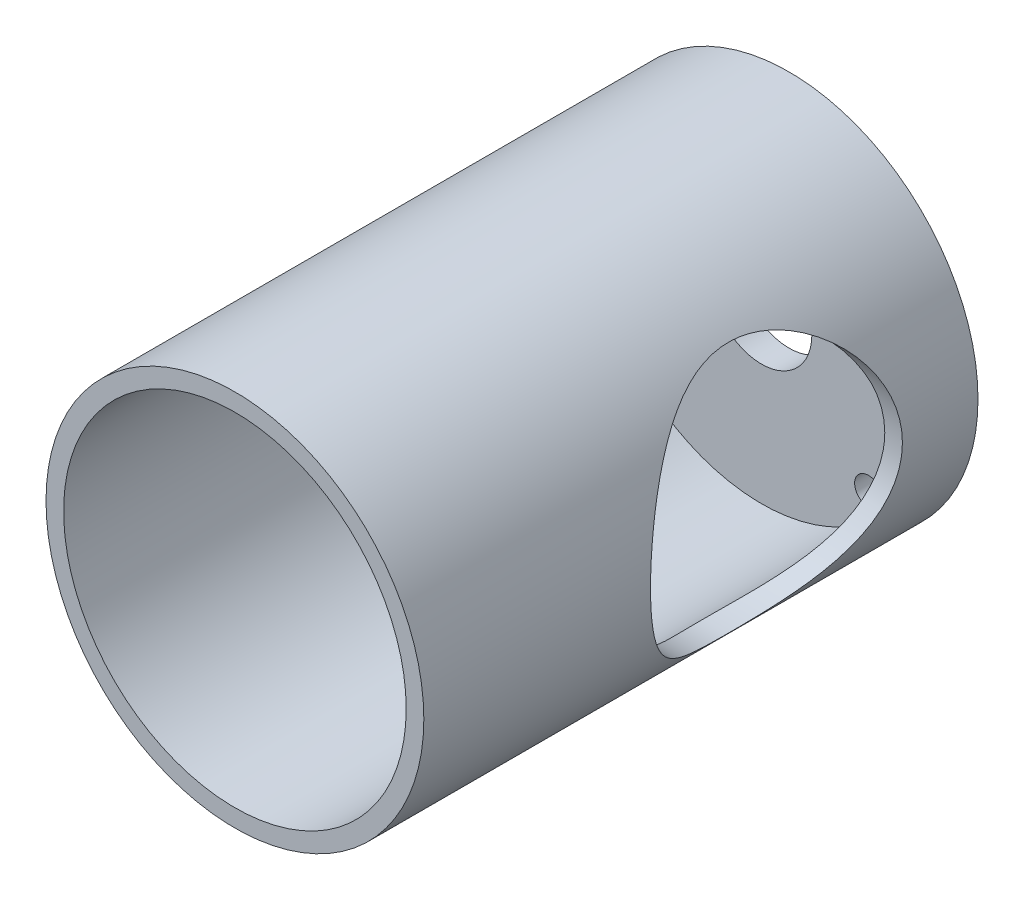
from build123d import *

# Parameters (mm, degrees)
SKETCH1_W               = 0.3048
SKETCH1_H               = 2.7
SKETCH2_R               = 1.7272
CUT_EXTRUDE1_DEPTH      = 12.7
CIRPATTERN1_COUNT       = 4
CUT_EXTRUDE2_DEPTH      = 78.544134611
CUT_EXTRUDE2_DEPTH_BACK = 78.544134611
SKETCH3_R               = 15.875


with BuildPart() as part:
    # Sketch1 → Revolve1 (revolve)
    with BuildSketch(Plane(origin=(0, 0, 0), x_dir=(0, 0, -1), z_dir=(1, 0, 0)), mode=Mode.PRIVATE) as revolve1_sk:
        Polygon((-3.4798, 21.59), (-3.4798, 6.35), (-0.3048, 6.35), (-0.3048, 9.05), (0, 9.05), (0, 23.8125), (-69.85, 23.8125), (-69.85, 21.59), align=None)
        with Locations((-0.1524, 7.7)):
            Rectangle(SKETCH1_W, SKETCH1_H)
    revolve(revolve1_sk.sketch.rotate(Axis((0, 0, 8.824688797), (0, 0, -1)), 90), axis=Axis((0, 0, 8.824688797), (0, 0, -1)))

    # Sketch2 → Cut-Extrude1 (cut)
    with BuildSketch(Plane(origin=(0, 0, 0), x_dir=(-1, 0, 0), z_dir=(0, 0, -1))):
        with Locations((13.470384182, 13.470384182)):
            Circle(SKETCH2_R)
    cut_extrude1 = extrude(amount=-CUT_EXTRUDE1_DEPTH, mode=Mode.SUBTRACT)

    # CirPattern1: Cut-Extrude1 ×4 about axis
    cirpattern1_axis = Axis((0, 0, 0), (0, 0, 1))
    for i in range(1, CIRPATTERN1_COUNT):
        add(cut_extrude1.rotate(cirpattern1_axis, i * 360 / CIRPATTERN1_COUNT), mode=Mode.SUBTRACT)

    # Sketch3 → Cut-Extrude2 (cut, two sides: drawn at the far end of the back side and taken through both)
    with BuildSketch(Plane(origin=(0, 0, 0), x_dir=(0, 0, -1), z_dir=(1, 0, 0)).offset(-CUT_EXTRUDE2_DEPTH_BACK)):
        with Locations((-25.4, 0)):
            Circle(SKETCH3_R)
    extrude(amount=CUT_EXTRUDE2_DEPTH + CUT_EXTRUDE2_DEPTH_BACK, mode=Mode.SUBTRACT)


solid = part.part
